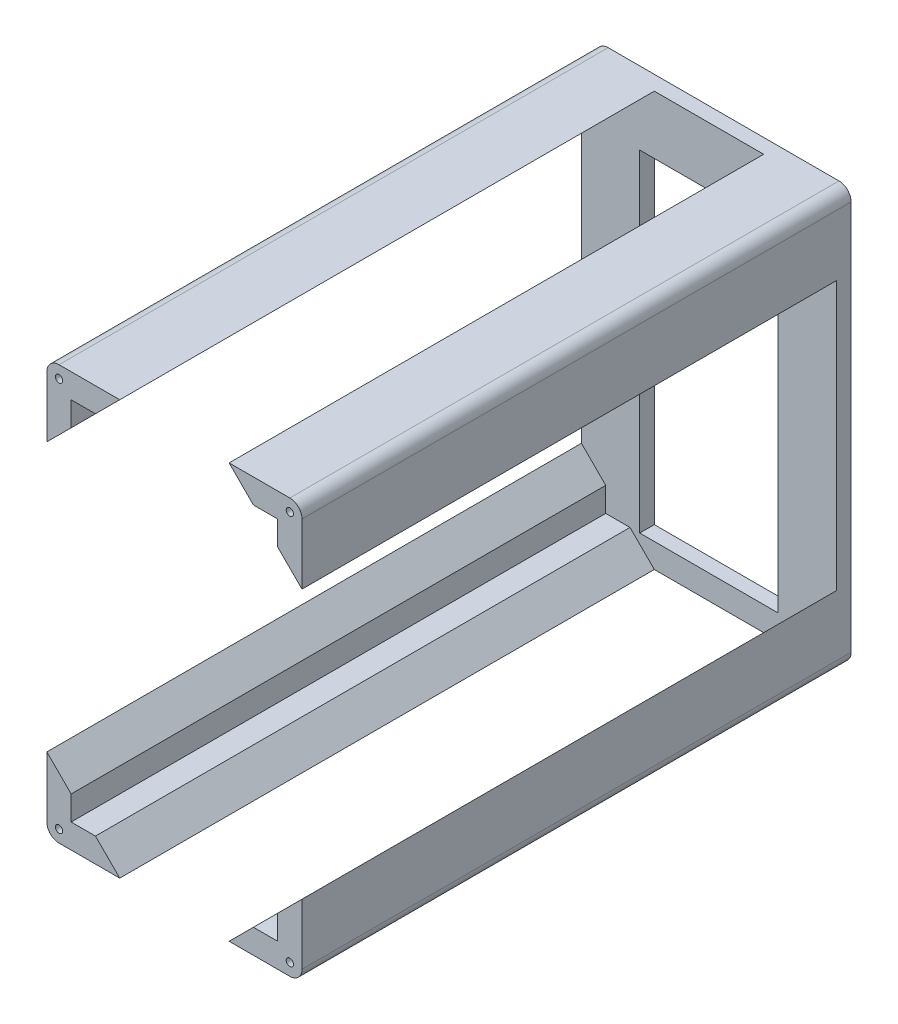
from build123d import *

# Parameters (mm, degrees)
CROQUIS7_W                = 105
CROQUIS7_H                = 170.5
SALIENTE_EXTRUIR7_DEPTH   = 6
SALIENTE_EXTRUIR8_DEPTH   = 220
CROQUIS9_W                = 57
CROQUIS9_H                = 136.5
CORTAR_EXTRUIR1_DEPTH     = 6
CROQUIS13_W               = 85
CROQUIS13_H               = 150.5
CORTAR_EXTRUIR3_DEPTH     = 220
REDONDEO4_R               = 5
REDONDEO5_R               = 5
REDONDEO6_R               = 5
F_3_0MM_DOWEL_HOLE1_D     = 3
F_3_0MM_DOWEL_HOLE1_DEPTH = 5


with BuildPart() as part:
    # Croquis7 → Saliente-Extruir7 (new body)
    with BuildSketch(Plane.XY):
        with Locations((-462.828787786, -14.25)):
            Rectangle(CROQUIS7_W, CROQUIS7_H)
    extrude(amount=SALIENTE_EXTRUIR7_DEPTH)

    # Croquis8 → Saliente-Extruir8 (add)
    with BuildSketch(Plane.XY.offset(6)):
        Polygon((-515.328787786, 71), (-485.328787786, 71), (-515.328787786, 41), align=None)
        Polygon((-410.328787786, 71), (-410.328787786, 41), (-440.328787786, 71), align=None)
        Polygon((-485.328787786, -99.5), (-515.328787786, -99.5), (-515.328787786, -69.5), align=None)
        Polygon((-410.328787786, -69.5), (-410.328787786, -99.5), (-440.328787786, -99.5), align=None)
    extrude(amount=SALIENTE_EXTRUIR8_DEPTH)

    # Croquis9 → Cortar-Extruir1 (cut)
    with BuildSketch(Plane(origin=(0, 0, 0), x_dir=(-1, 0, 0), z_dir=(0, 0, -1))):
        with Locations((462.828787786, -21.25)):
            Rectangle(CROQUIS9_W, CROQUIS9_H)
    extrude(amount=-CORTAR_EXTRUIR1_DEPTH, mode=Mode.SUBTRACT)

    # Croquis13 → Cortar-Extruir3 (cut)
    with BuildSketch(Plane.XY.offset(226)):
        with Locations((-462.828787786, -14.25)):
            Rectangle(CROQUIS13_W, CROQUIS13_H)
    extrude(amount=-CORTAR_EXTRUIR3_DEPTH, mode=Mode.SUBTRACT)

    # Redondeo4
    redondeo4_edges = [part.edges().sort_by_distance(p)[0] for p in [
        (-515.328787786, -99.5, 113),
        (-410.328787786, -99.5, 113),
    ]]
    fillet(redondeo4_edges, radius=REDONDEO4_R)

    # Redondeo5
    redondeo5_edges = [part.edges().sort_by_distance(p)[0] for p in [
        (-515.328787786, 71, 113),
    ]]
    fillet(redondeo5_edges, radius=REDONDEO5_R)

    # Redondeo6
    redondeo6_edges = [part.edges().sort_by_distance(p)[0] for p in [
        (-410.328787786, 71, 113),
    ]]
    fillet(redondeo6_edges, radius=REDONDEO6_R)

    # 3.0mm Dowel Hole1
    with Locations(Plane(origin=(-510.328787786, 66, 226), x_dir=(1, 0, 0), z_dir=(0, 0, 1))):
        with Locations((0, 0), (95, 0), (95, -160.5), (0, -160.5)):
            Hole(F_3_0MM_DOWEL_HOLE1_D / 2, depth=F_3_0MM_DOWEL_HOLE1_DEPTH)


solid = part.part
